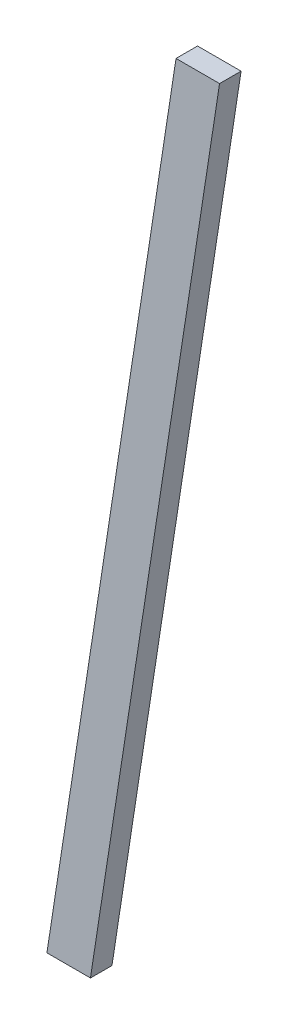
ISO-10303-21;
HEADER;
FILE_DESCRIPTION(('STEP AP214'),'2;1');
FILE_NAME('part.step','',(''),(''),'','','');
FILE_SCHEMA(('AUTOMOTIVE_DESIGN { 1 0 10303 214 1 1 1 1 }'));
ENDSEC;
DATA;
#1=APPLICATION_CONTEXT('core data for automotive mechanical design processes');
#2=APPLICATION_PROTOCOL_DEFINITION('international standard','automotive_design',2000,#1);
#3=PRODUCT_CONTEXT('',#1,'mechanical');
#4=PRODUCT('Part','Part','',(#3));
#5=PRODUCT_RELATED_PRODUCT_CATEGORY('part','',(#4));
#6=PRODUCT_DEFINITION_FORMATION('','',#4);
#7=PRODUCT_DEFINITION_CONTEXT('part definition',#1,'design');
#8=PRODUCT_DEFINITION('design','',#6,#7);
#9=PRODUCT_DEFINITION_SHAPE('','',#8);
#10=(LENGTH_UNIT() NAMED_UNIT(*) SI_UNIT(.MILLI.,.METRE.));
#11=(NAMED_UNIT(*) PLANE_ANGLE_UNIT() SI_UNIT($,.RADIAN.));
#12=(NAMED_UNIT(*) SI_UNIT($,.STERADIAN.) SOLID_ANGLE_UNIT());
#13=UNCERTAINTY_MEASURE_WITH_UNIT(LENGTH_MEASURE(1.E-05),#10,'distance_accuracy_value','');
#14=(GEOMETRIC_REPRESENTATION_CONTEXT(3) GLOBAL_UNCERTAINTY_ASSIGNED_CONTEXT((#13)) GLOBAL_UNIT_ASSIGNED_CONTEXT((#10,
#11,#12)) REPRESENTATION_CONTEXT('',''));
#15=CARTESIAN_POINT('',(0.,0.,0.));
#16=DIRECTION('',(0.,0.,1.));
#17=DIRECTION('',(1.,0.,0.));
#18=AXIS2_PLACEMENT_3D('',#15,#16,#17);
#19=CARTESIAN_POINT('',(-1219.2,0.,50.8));
#20=DIRECTION('',(0.,1.,0.));
#21=DIRECTION('',(-1.,0.,0.));
#22=AXIS2_PLACEMENT_3D('',#19,#20,#21);
#23=PLANE('',#22);
#24=DIRECTION('',(1.,0.,0.));
#25=VECTOR('',#24,1.);
#26=CARTESIAN_POINT('',(-1219.2,0.,0.));
#27=LINE('',#26,#25);
#28=CARTESIAN_POINT('',(-1219.2,0.,0.));
#29=VERTEX_POINT('',#28);
#30=CARTESIAN_POINT('',(-1116.40466476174,0.,0.));
#31=VERTEX_POINT('',#30);
#32=EDGE_CURVE('E96',#29,#31,#27,.T.);
#33=ORIENTED_EDGE('',*,*,#32,.T.);
#34=DIRECTION('',(0.,0.,-1.));
#35=VECTOR('',#34,1.);
#36=CARTESIAN_POINT('',(-1116.40466476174,0.,50.8));
#37=LINE('',#36,#35);
#38=CARTESIAN_POINT('',(-1116.40466476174,0.,50.8));
#39=VERTEX_POINT('',#38);
#40=EDGE_CURVE('E11',#39,#31,#37,.T.);
#41=ORIENTED_EDGE('',*,*,#40,.F.);
#42=DIRECTION('',(1.,0.,0.));
#43=VECTOR('',#42,1.);
#44=CARTESIAN_POINT('',(-1219.2,0.,50.8));
#45=LINE('',#44,#43);
#46=CARTESIAN_POINT('',(-1219.2,0.,50.8));
#47=VERTEX_POINT('',#46);
#48=EDGE_CURVE('E84',#47,#39,#45,.T.);
#49=ORIENTED_EDGE('',*,*,#48,.F.);
#50=DIRECTION('',(0.,0.,-1.));
#51=VECTOR('',#50,1.);
#52=CARTESIAN_POINT('',(-1219.2,0.,50.8));
#53=LINE('',#52,#51);
#54=EDGE_CURVE('E92',#47,#29,#53,.T.);
#55=ORIENTED_EDGE('',*,*,#54,.T.);
#56=EDGE_LOOP('',(#33,#41,#49,#55));
#57=FACE_BOUND('',#56,.T.);
#58=ADVANCED_FACE('F33',(#57),#23,.F.);
#59=CARTESIAN_POINT('',(-1116.40466476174,0.,50.8));
#60=DIRECTION('',(-0.988371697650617,0.152057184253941,0.));
#61=DIRECTION('',(-0.152057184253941,-0.988371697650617,0.));
#62=AXIS2_PLACEMENT_3D('',#59,#60,#61);
#63=PLANE('',#62);
#64=DIRECTION('',(0.152057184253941,0.988371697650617,0.));
#65=VECTOR('',#64,1.);
#66=CARTESIAN_POINT('',(-1116.40466476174,0.,0.));
#67=LINE('',#66,#65);
#68=CARTESIAN_POINT('',(-811.604664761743,1981.2,0.));
#69=VERTEX_POINT('',#68);
#70=EDGE_CURVE('E88',#31,#69,#67,.T.);
#71=ORIENTED_EDGE('',*,*,#70,.T.);
#72=DIRECTION('',(0.,0.,-1.));
#73=VECTOR('',#72,1.);
#74=CARTESIAN_POINT('',(-811.604664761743,1981.2,50.8));
#75=LINE('',#74,#73);
#76=CARTESIAN_POINT('',(-811.604664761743,1981.2,50.8));
#77=VERTEX_POINT('',#76);
#78=EDGE_CURVE('E41',#77,#69,#75,.T.);
#79=ORIENTED_EDGE('',*,*,#78,.F.);
#80=DIRECTION('',(0.152057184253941,0.988371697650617,0.));
#81=VECTOR('',#80,1.);
#82=CARTESIAN_POINT('',(-1116.40466476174,0.,50.8));
#83=LINE('',#82,#81);
#84=EDGE_CURVE('E79',#39,#77,#83,.T.);
#85=ORIENTED_EDGE('',*,*,#84,.F.);
#86=ORIENTED_EDGE('',*,*,#40,.T.);
#87=EDGE_LOOP('',(#71,#79,#85,#86));
#88=FACE_BOUND('',#87,.T.);
#89=ADVANCED_FACE('F87',(#88),#63,.F.);
#90=CARTESIAN_POINT('',(-914.4,1981.2,50.8));
#91=DIRECTION('',(0.,-1.,0.));
#92=DIRECTION('',(0.,0.,-1.));
#93=AXIS2_PLACEMENT_3D('',#90,#91,#92);
#94=PLANE('',#93);
#95=DIRECTION('',(-1.,0.,0.));
#96=VECTOR('',#95,1.);
#97=CARTESIAN_POINT('',(-914.4,1981.2,0.));
#98=LINE('',#97,#96);
#99=CARTESIAN_POINT('',(-914.4,1981.2,0.));
#100=VERTEX_POINT('',#99);
#101=EDGE_CURVE('E66',#69,#100,#98,.T.);
#102=ORIENTED_EDGE('',*,*,#101,.T.);
#103=DIRECTION('',(0.,0.,-1.));
#104=VECTOR('',#103,1.);
#105=CARTESIAN_POINT('',(-914.4,1981.2,50.8));
#106=LINE('',#105,#104);
#107=CARTESIAN_POINT('',(-914.4,1981.2,50.8));
#108=VERTEX_POINT('',#107);
#109=EDGE_CURVE('E89',#108,#100,#106,.T.);
#110=ORIENTED_EDGE('',*,*,#109,.F.);
#111=DIRECTION('',(-1.,0.,0.));
#112=VECTOR('',#111,1.);
#113=CARTESIAN_POINT('',(-914.4,1981.2,50.8));
#114=LINE('',#113,#112);
#115=EDGE_CURVE('E82',#77,#108,#114,.T.);
#116=ORIENTED_EDGE('',*,*,#115,.F.);
#117=ORIENTED_EDGE('',*,*,#78,.T.);
#118=EDGE_LOOP('',(#102,#110,#116,#117));
#119=FACE_BOUND('',#118,.T.);
#120=ADVANCED_FACE('F90',(#119),#94,.F.);
#121=CARTESIAN_POINT('',(-1219.2,0.,50.8));
#122=DIRECTION('',(0.988371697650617,-0.152057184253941,0.));
#123=DIRECTION('',(0.152057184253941,0.988371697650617,0.));
#124=AXIS2_PLACEMENT_3D('',#121,#122,#123);
#125=PLANE('',#124);
#126=DIRECTION('',(-0.152057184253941,-0.988371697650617,0.));
#127=VECTOR('',#126,1.);
#128=CARTESIAN_POINT('',(-1219.2,0.,0.));
#129=LINE('',#128,#127);
#130=EDGE_CURVE('E72',#100,#29,#129,.T.);
#131=ORIENTED_EDGE('',*,*,#130,.T.);
#132=ORIENTED_EDGE('',*,*,#54,.F.);
#133=DIRECTION('',(-0.152057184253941,-0.988371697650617,0.));
#134=VECTOR('',#133,1.);
#135=CARTESIAN_POINT('',(-1219.2,0.,50.8));
#136=LINE('',#135,#134);
#137=EDGE_CURVE('E49',#108,#47,#136,.T.);
#138=ORIENTED_EDGE('',*,*,#137,.F.);
#139=ORIENTED_EDGE('',*,*,#109,.T.);
#140=EDGE_LOOP('',(#131,#132,#138,#139));
#141=FACE_BOUND('',#140,.T.);
#142=ADVANCED_FACE('F103',(#141),#125,.F.);
#143=CARTESIAN_POINT('',(0.,0.,50.8));
#144=DIRECTION('',(0.,0.,1.));
#145=DIRECTION('',(1.,0.,0.));
#146=AXIS2_PLACEMENT_3D('',#143,#144,#145);
#147=PLANE('',#146);
#148=ORIENTED_EDGE('',*,*,#48,.T.);
#149=ORIENTED_EDGE('',*,*,#84,.T.);
#150=ORIENTED_EDGE('',*,*,#115,.T.);
#151=ORIENTED_EDGE('',*,*,#137,.T.);
#152=EDGE_LOOP('',(#148,#149,#150,#151));
#153=FACE_BOUND('',#152,.T.);
#154=ADVANCED_FACE('F80',(#153),#147,.T.);
#155=CARTESIAN_POINT('',(0.,0.,0.));
#156=DIRECTION('',(0.,0.,1.));
#157=DIRECTION('',(1.,0.,0.));
#158=AXIS2_PLACEMENT_3D('',#155,#156,#157);
#159=PLANE('',#158);
#160=ORIENTED_EDGE('',*,*,#32,.F.);
#161=ORIENTED_EDGE('',*,*,#130,.F.);
#162=ORIENTED_EDGE('',*,*,#101,.F.);
#163=ORIENTED_EDGE('',*,*,#70,.F.);
#164=EDGE_LOOP('',(#160,#161,#162,#163));
#165=FACE_BOUND('',#164,.T.);
#166=ADVANCED_FACE('F106',(#165),#159,.F.);
#167=CLOSED_SHELL('',(#58,#89,#120,#142,#154,#166));
#168=MANIFOLD_SOLID_BREP('B2',#167);
#169=ADVANCED_BREP_SHAPE_REPRESENTATION('',(#18,#168),#14);
#170=SHAPE_DEFINITION_REPRESENTATION(#9,#169);
ENDSEC;
END-ISO-10303-21;
